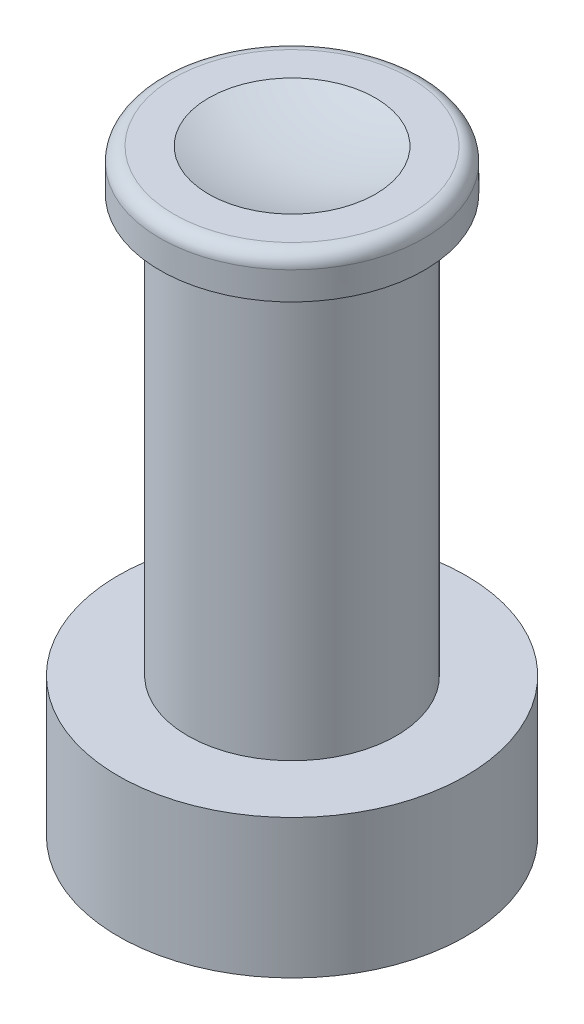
from build123d import *

# Parameters (mm, degrees)
SKETCH1_R      = 1.905
EXTRUDE1_DEPTH = 7.62
SKETCH2_R      = 2.413
EXTRUDE2_DEPTH = 0.762
SKETCH3_R      = 3.175
EXTRUDE3_DEPTH = 2.54
FILLET1_R      = 0.254


with BuildPart() as part:
    # Sketch1 → Extrude1 (new body)
    with BuildSketch(Plane(origin=(0, 0, 0), x_dir=(1, 0, 0), z_dir=(0, 1, 0))):
        with Locations(Location((0, 0, 0), (0, 0, 270))):
            Circle(SKETCH1_R)
    extrude(amount=-EXTRUDE1_DEPTH)

    # Sketch2 → Extrude2 (add)
    with BuildSketch(Plane(origin=(0, 0, 0), x_dir=(1, 0, 0), z_dir=(0, 1, 0))):
        with Locations(Location((0, 0, 0), (0, 0, 90))):
            Circle(SKETCH2_R)
    extrude(amount=EXTRUDE2_DEPTH)

    # Sketch3 → Extrude3 (add)
    with BuildSketch(Plane.XZ.offset(7.62)):
        with Locations(Location((0, 0, 0), (0, 0, 270))):
            Circle(SKETCH3_R)
    extrude(amount=EXTRUDE3_DEPTH)

    # Fillet1
    fillet1_edges = [part.edges().sort_by_distance(p)[0] for p in [
        (0, 0.762, 2.413),
    ]]
    fillet(fillet1_edges, radius=FILLET1_R)

    # Sketch4 → Cut-Revolve1 (revolve, cut)
    with BuildSketch(Plane.XY, mode=Mode.PRIVATE) as cut_revolve1_sk:
        with BuildLine():
            Line((0, 0.508), (0, 0.762))
            Line((0, 0.762), (1.524, 0.762))
            ThreePointArc((1.524, 0.762), (0.772510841, 0.571934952), (0, 0.508))
        make_face()
    revolve(cut_revolve1_sk.sketch.rotate(Axis((0, 0, 0), (0, 1, 0)), 270), axis=Axis((0, 0, 0), (0, 1, 0)), mode=Mode.SUBTRACT)


solid = part.part
